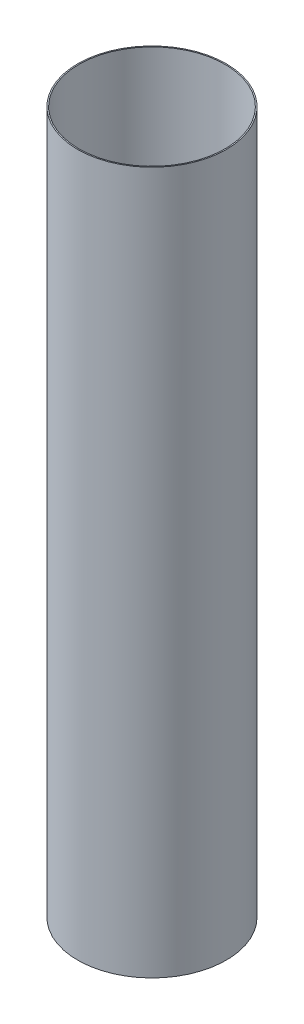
ISO-10303-21;
HEADER;
FILE_DESCRIPTION(('STEP AP214'),'2;1');
FILE_NAME('part.step','',(''),(''),'','','');
FILE_SCHEMA(('AUTOMOTIVE_DESIGN { 1 0 10303 214 1 1 1 1 }'));
ENDSEC;
DATA;
#1=APPLICATION_CONTEXT('core data for automotive mechanical design processes');
#2=APPLICATION_PROTOCOL_DEFINITION('international standard','automotive_design',2000,#1);
#3=PRODUCT_CONTEXT('',#1,'mechanical');
#4=PRODUCT('Part','Part','',(#3));
#5=PRODUCT_RELATED_PRODUCT_CATEGORY('part','',(#4));
#6=PRODUCT_DEFINITION_FORMATION('','',#4);
#7=PRODUCT_DEFINITION_CONTEXT('part definition',#1,'design');
#8=PRODUCT_DEFINITION('design','',#6,#7);
#9=PRODUCT_DEFINITION_SHAPE('','',#8);
#10=(LENGTH_UNIT() NAMED_UNIT(*) SI_UNIT(.MILLI.,.METRE.));
#11=(NAMED_UNIT(*) PLANE_ANGLE_UNIT() SI_UNIT($,.RADIAN.));
#12=(NAMED_UNIT(*) SI_UNIT($,.STERADIAN.) SOLID_ANGLE_UNIT());
#13=UNCERTAINTY_MEASURE_WITH_UNIT(LENGTH_MEASURE(1.E-05),#10,'distance_accuracy_value','');
#14=(GEOMETRIC_REPRESENTATION_CONTEXT(3) GLOBAL_UNCERTAINTY_ASSIGNED_CONTEXT((#13)) GLOBAL_UNIT_ASSIGNED_CONTEXT((#10,
#11,#12)) REPRESENTATION_CONTEXT('',''));
#15=CARTESIAN_POINT('',(0.,0.,0.));
#16=DIRECTION('',(0.,0.,1.));
#17=DIRECTION('',(1.,0.,0.));
#18=AXIS2_PLACEMENT_3D('',#15,#16,#17);
#19=CARTESIAN_POINT('',(0.,0.,0.));
#20=DIRECTION('',(0.,1.,0.));
#21=DIRECTION('',(0.,0.,1.));
#22=AXIS2_PLACEMENT_3D('',#19,#20,#21);
#23=PLANE('',#22);
#24=DIRECTION('',(-1.,0.,0.));
#25=VECTOR('',#24,1.);
#26=CARTESIAN_POINT('',(-153.162,0.,2.54));
#27=LINE('',#26,#25);
#28=CARTESIAN_POINT('',(-158.729678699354,0.,2.54));
#29=VERTEX_POINT('',#28);
#30=CARTESIAN_POINT('',(-161.269998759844,0.,2.54));
#31=VERTEX_POINT('',#30);
#32=EDGE_CURVE('E112',#29,#31,#27,.T.);
#33=ORIENTED_EDGE('',*,*,#32,.F.);
#34=CARTESIAN_POINT('',(0.,0.,0.));
#35=DIRECTION('',(0.,1.,0.));
#36=DIRECTION('',(0.,0.,1.));
#37=AXIS2_PLACEMENT_3D('',#34,#35,#36);
#38=CIRCLE('',#37,158.75);
#39=CARTESIAN_POINT('',(-158.729678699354,0.,-2.54000000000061));
#40=VERTEX_POINT('',#39);
#41=EDGE_CURVE('E101',#29,#40,#38,.T.);
#42=ORIENTED_EDGE('',*,*,#41,.T.);
#43=DIRECTION('',(-1.,0.,0.));
#44=VECTOR('',#43,1.);
#45=CARTESIAN_POINT('',(-153.162,0.,-2.53999999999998));
#46=LINE('',#45,#44);
#47=CARTESIAN_POINT('',(-161.269998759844,0.,-2.53999999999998));
#48=VERTEX_POINT('',#47);
#49=EDGE_CURVE('E53',#40,#48,#46,.T.);
#50=ORIENTED_EDGE('',*,*,#49,.T.);
#51=CARTESIAN_POINT('',(0.,0.,0.));
#52=DIRECTION('',(0.,1.,0.));
#53=DIRECTION('',(1.,0.,0.));
#54=AXIS2_PLACEMENT_3D('',#51,#52,#53);
#55=CIRCLE('',#54,161.29);
#56=EDGE_CURVE('E95',#31,#48,#55,.T.);
#57=ORIENTED_EDGE('',*,*,#56,.F.);
#58=EDGE_LOOP('',(#33,#42,#50,#57));
#59=FACE_BOUND('',#58,.T.);
#60=ADVANCED_FACE('F38',(#59),#23,.F.);
#61=CARTESIAN_POINT('',(0.,1524.,0.));
#62=DIRECTION('',(0.,-1.,0.));
#63=DIRECTION('',(0.,0.,-1.));
#64=AXIS2_PLACEMENT_3D('',#61,#62,#63);
#65=CYLINDRICAL_SURFACE('',#64,158.75);
#66=CARTESIAN_POINT('',(0.,1524.,0.));
#67=DIRECTION('',(0.,1.,0.));
#68=DIRECTION('',(0.,0.,1.));
#69=AXIS2_PLACEMENT_3D('',#66,#67,#68);
#70=CIRCLE('',#69,158.75);
#71=CARTESIAN_POINT('',(0.,1524.,158.75));
#72=VERTEX_POINT('',#71);
#73=EDGE_CURVE('E98',#72,#72,#70,.T.);
#74=ORIENTED_EDGE('',*,*,#73,.T.);
#75=EDGE_LOOP('',(#74));
#76=FACE_BOUND('',#75,.T.);
#77=ORIENTED_EDGE('',*,*,#41,.F.);
#78=DIRECTION('',(0.,-1.,0.));
#79=VECTOR('',#78,1.);
#80=CARTESIAN_POINT('',(-158.729678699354,1524.,2.54000000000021));
#81=LINE('',#80,#79);
#82=CARTESIAN_POINT('',(-158.729678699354,25.4,2.54000000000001));
#83=VERTEX_POINT('',#82);
#84=EDGE_CURVE('E12',#29,#83,#81,.F.);
#85=ORIENTED_EDGE('',*,*,#84,.T.);
#86=CARTESIAN_POINT('',(0.,25.3999999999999,0.));
#87=DIRECTION('',(0.,1.,0.));
#88=DIRECTION('',(-1.,0.,0.));
#89=AXIS2_PLACEMENT_3D('',#86,#87,#88);
#90=CIRCLE('',#89,158.75);
#91=CARTESIAN_POINT('',(-158.729678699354,25.4,-2.53999999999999));
#92=VERTEX_POINT('',#91);
#93=EDGE_CURVE('E46',#92,#83,#90,.T.);
#94=ORIENTED_EDGE('',*,*,#93,.F.);
#95=DIRECTION('',(0.,-1.,0.));
#96=VECTOR('',#95,1.);
#97=CARTESIAN_POINT('',(-158.729678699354,1524.,-2.54000000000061));
#98=LINE('',#97,#96);
#99=EDGE_CURVE('E78',#40,#92,#98,.F.);
#100=ORIENTED_EDGE('',*,*,#99,.F.);
#101=EDGE_LOOP('',(#77,#85,#94,#100));
#102=FACE_BOUND('',#101,.T.);
#103=ADVANCED_FACE('F93',(#76,#102),#65,.F.);
#104=CARTESIAN_POINT('',(0.,1524.,0.));
#105=DIRECTION('',(0.,1.,0.));
#106=DIRECTION('',(0.,0.,1.));
#107=AXIS2_PLACEMENT_3D('',#104,#105,#106);
#108=PLANE('',#107);
#109=CARTESIAN_POINT('',(0.,1524.,0.));
#110=DIRECTION('',(0.,1.,0.));
#111=DIRECTION('',(1.,0.,0.));
#112=AXIS2_PLACEMENT_3D('',#109,#110,#111);
#113=CIRCLE('',#112,161.29);
#114=CARTESIAN_POINT('',(161.29,1524.,0.));
#115=VERTEX_POINT('',#114);
#116=EDGE_CURVE('E86',#115,#115,#113,.T.);
#117=ORIENTED_EDGE('',*,*,#116,.T.);
#118=EDGE_LOOP('',(#117));
#119=FACE_BOUND('',#118,.T.);
#120=ORIENTED_EDGE('',*,*,#73,.F.);
#121=EDGE_LOOP('',(#120));
#122=FACE_BOUND('',#121,.T.);
#123=ADVANCED_FACE('F123',(#119,#122),#108,.T.);
#124=CARTESIAN_POINT('',(0.,1524.,0.));
#125=DIRECTION('',(0.,-1.,0.));
#126=DIRECTION('',(0.,0.,-1.));
#127=AXIS2_PLACEMENT_3D('',#124,#125,#126);
#128=CYLINDRICAL_SURFACE('',#127,161.29);
#129=ORIENTED_EDGE('',*,*,#116,.F.);
#130=EDGE_LOOP('',(#129));
#131=FACE_BOUND('',#130,.T.);
#132=CARTESIAN_POINT('',(0.,25.3999999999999,0.));
#133=DIRECTION('',(0.,1.,0.));
#134=DIRECTION('',(-1.,0.,0.));
#135=AXIS2_PLACEMENT_3D('',#132,#133,#134);
#136=CIRCLE('',#135,161.29);
#137=CARTESIAN_POINT('',(-161.269998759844,25.4,-2.53999999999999));
#138=VERTEX_POINT('',#137);
#139=CARTESIAN_POINT('',(-161.269998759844,25.4,2.54000000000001));
#140=VERTEX_POINT('',#139);
#141=EDGE_CURVE('E61',#138,#140,#136,.T.);
#142=ORIENTED_EDGE('',*,*,#141,.T.);
#143=DIRECTION('',(0.,-1.,0.));
#144=VECTOR('',#143,1.);
#145=CARTESIAN_POINT('',(-161.269998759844,1524.,2.54000000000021));
#146=LINE('',#145,#144);
#147=EDGE_CURVE('E106',#31,#140,#146,.F.);
#148=ORIENTED_EDGE('',*,*,#147,.F.);
#149=ORIENTED_EDGE('',*,*,#56,.T.);
#150=DIRECTION('',(0.,-1.,0.));
#151=VECTOR('',#150,1.);
#152=CARTESIAN_POINT('',(-161.269998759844,1524.,-2.54000000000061));
#153=LINE('',#152,#151);
#154=EDGE_CURVE('E108',#48,#138,#153,.F.);
#155=ORIENTED_EDGE('',*,*,#154,.T.);
#156=EDGE_LOOP('',(#142,#148,#149,#155));
#157=FACE_BOUND('',#156,.T.);
#158=ADVANCED_FACE('F40',(#131,#157),#128,.T.);
#159=CARTESIAN_POINT('',(-153.162,25.4,2.54000000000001));
#160=DIRECTION('',(0.,1.,0.));
#161=DIRECTION('',(-1.,0.,0.));
#162=AXIS2_PLACEMENT_3D('',#159,#160,#161);
#163=PLANE('',#162);
#164=ORIENTED_EDGE('',*,*,#141,.F.);
#165=DIRECTION('',(-1.,0.,0.));
#166=VECTOR('',#165,1.);
#167=CARTESIAN_POINT('',(-153.162,25.4,-2.53999999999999));
#168=LINE('',#167,#166);
#169=EDGE_CURVE('E81',#92,#138,#168,.T.);
#170=ORIENTED_EDGE('',*,*,#169,.F.);
#171=ORIENTED_EDGE('',*,*,#93,.T.);
#172=DIRECTION('',(-1.,0.,0.));
#173=VECTOR('',#172,1.);
#174=CARTESIAN_POINT('',(-153.162,25.4,2.54000000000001));
#175=LINE('',#174,#173);
#176=EDGE_CURVE('E109',#83,#140,#175,.T.);
#177=ORIENTED_EDGE('',*,*,#176,.T.);
#178=EDGE_LOOP('',(#164,#170,#171,#177));
#179=FACE_BOUND('',#178,.T.);
#180=ADVANCED_FACE('F89',(#179),#163,.F.);
#181=CARTESIAN_POINT('',(-153.162,25.4,2.54000000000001));
#182=DIRECTION('',(0.,0.,-1.));
#183=DIRECTION('',(0.,1.,0.));
#184=AXIS2_PLACEMENT_3D('',#181,#182,#183);
#185=PLANE('',#184);
#186=ORIENTED_EDGE('',*,*,#147,.T.);
#187=ORIENTED_EDGE('',*,*,#176,.F.);
#188=ORIENTED_EDGE('',*,*,#84,.F.);
#189=ORIENTED_EDGE('',*,*,#32,.T.);
#190=EDGE_LOOP('',(#186,#187,#188,#189));
#191=FACE_BOUND('',#190,.T.);
#192=ADVANCED_FACE('F115',(#191),#185,.T.);
#193=CARTESIAN_POINT('',(-153.162,25.4,-2.53999999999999));
#194=DIRECTION('',(0.,0.,-1.));
#195=DIRECTION('',(0.,1.,0.));
#196=AXIS2_PLACEMENT_3D('',#193,#194,#195);
#197=PLANE('',#196);
#198=ORIENTED_EDGE('',*,*,#49,.F.);
#199=ORIENTED_EDGE('',*,*,#99,.T.);
#200=ORIENTED_EDGE('',*,*,#169,.T.);
#201=ORIENTED_EDGE('',*,*,#154,.F.);
#202=EDGE_LOOP('',(#198,#199,#200,#201));
#203=FACE_BOUND('',#202,.T.);
#204=ADVANCED_FACE('F80',(#203),#197,.F.);
#205=CLOSED_SHELL('',(#60,#103,#123,#158,#180,#192,#204));
#206=MANIFOLD_SOLID_BREP('B2',#205);
#207=ADVANCED_BREP_SHAPE_REPRESENTATION('',(#18,#206),#14);
#208=SHAPE_DEFINITION_REPRESENTATION(#9,#207);
ENDSEC;
END-ISO-10303-21;
